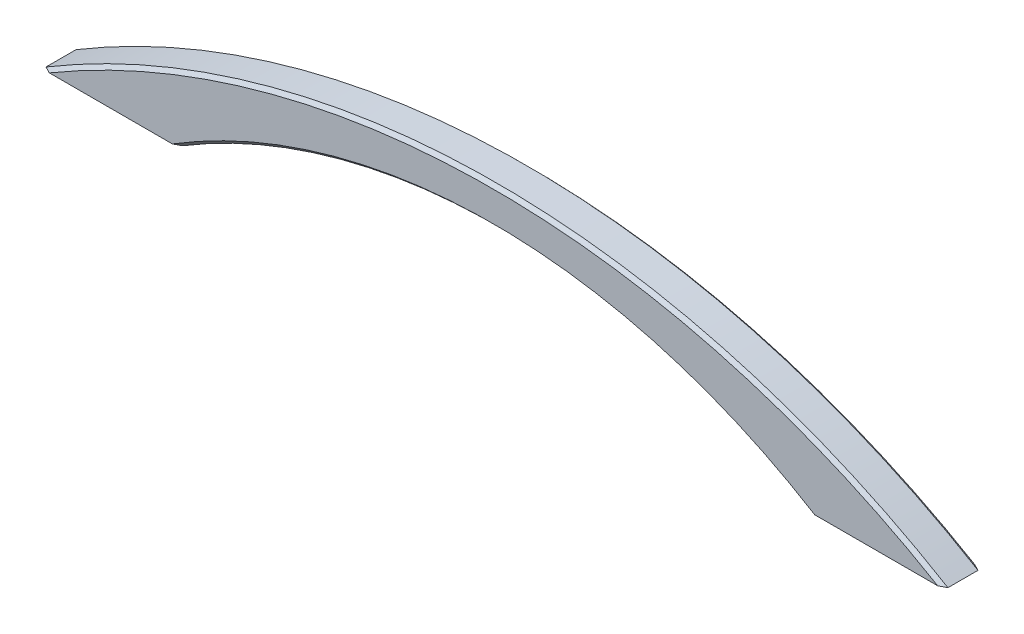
from build123d import *

# Parameters (mm, degrees)
EXTRUDE_1_DEPTH = 4
M4X0_7_1_D      = 3.3
M4X0_7_1_DEPTH  = 6
M4X0_7_1_TIP    = 0.991420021
CHAMFER_1_SIZE  = 0.75


with BuildPart() as part:
    # Sketch 1 → Extrude 1 (new, symmetric)
    with BuildSketch(Plane.XY):
        with BuildLine():
            Line((-68, 0), (-97.5, 0))
            ThreePointArc((-97.5, 0), (0, 27), (97.5, 0))
            Line((97.5, 0), (68, 0))
            ThreePointArc((68, 0), (0, 19), (-68, 0))
        make_face()
    extrude(amount=EXTRUDE_1_DEPTH, both=True)

    # M4x0.7 _1
    with Locations(Plane(origin=(0, 0, 0), x_dir=(-1, 0, 0), z_dir=(0, -1, 0))):
        with Locations((75, 0), (-75, 0)):
            Hole(M4X0_7_1_D / 2, depth=M4X0_7_1_DEPTH)
            with Locations((0, 0, -(M4X0_7_1_DEPTH + M4X0_7_1_TIP / 2))):  # 118° drill point
                Cone(0, M4X0_7_1_D / 2, M4X0_7_1_TIP, mode=Mode.SUBTRACT)

    # Chamfer 1
    chamfer_1_edges = [part.edges().sort_by_distance(p)[0] for p in [
        (0, 27, 4),
        (0, 19, 4),
        (0, 27, -4),
        (0, 19, -4),
    ]]
    chamfer(chamfer_1_edges, length=CHAMFER_1_SIZE)


solid = part.part
